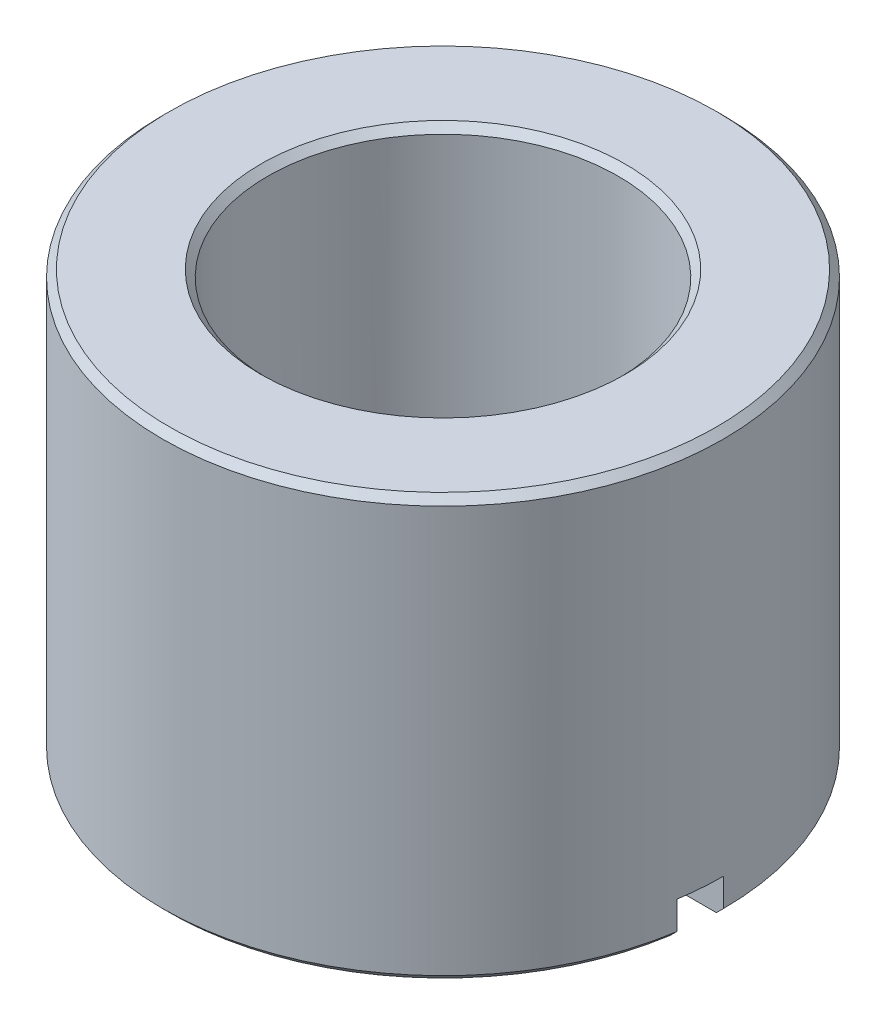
ISO-10303-21;
HEADER;
FILE_DESCRIPTION(('STEP AP214'),'2;1');
FILE_NAME('part.step','',(''),(''),'','','');
FILE_SCHEMA(('AUTOMOTIVE_DESIGN { 1 0 10303 214 1 1 1 1 }'));
ENDSEC;
DATA;
#1=APPLICATION_CONTEXT('core data for automotive mechanical design processes');
#2=APPLICATION_PROTOCOL_DEFINITION('international standard','automotive_design',2000,#1);
#3=PRODUCT_CONTEXT('',#1,'mechanical');
#4=PRODUCT('Part','Part','',(#3));
#5=PRODUCT_RELATED_PRODUCT_CATEGORY('part','',(#4));
#6=PRODUCT_DEFINITION_FORMATION('','',#4);
#7=PRODUCT_DEFINITION_CONTEXT('part definition',#1,'design');
#8=PRODUCT_DEFINITION('design','',#6,#7);
#9=PRODUCT_DEFINITION_SHAPE('','',#8);
#10=(LENGTH_UNIT() NAMED_UNIT(*) SI_UNIT(.MILLI.,.METRE.));
#11=(NAMED_UNIT(*) PLANE_ANGLE_UNIT() SI_UNIT($,.RADIAN.));
#12=(NAMED_UNIT(*) SI_UNIT($,.STERADIAN.) SOLID_ANGLE_UNIT());
#13=UNCERTAINTY_MEASURE_WITH_UNIT(LENGTH_MEASURE(1.E-05),#10,'distance_accuracy_value','');
#14=(GEOMETRIC_REPRESENTATION_CONTEXT(3) GLOBAL_UNCERTAINTY_ASSIGNED_CONTEXT((#13)) GLOBAL_UNIT_ASSIGNED_CONTEXT((#10,
#11,#12)) REPRESENTATION_CONTEXT('',''));
#15=CARTESIAN_POINT('',(0.,0.,0.));
#16=DIRECTION('',(0.,0.,1.));
#17=DIRECTION('',(1.,0.,0.));
#18=AXIS2_PLACEMENT_3D('',#15,#16,#17);
#19=CARTESIAN_POINT('',(2.,0.5,0.3085685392));
#20=DIRECTION('',(0.,1.,0.));
#21=DIRECTION('',(0.,0.,1.));
#22=AXIS2_PLACEMENT_3D('',#19,#20,#21);
#23=PLANE('',#22);
#24=DIRECTION('',(1.,0.,0.));
#25=VECTOR('',#24,1.);
#26=CARTESIAN_POINT('',(2.,0.5,0.));
#27=LINE('',#26,#25);
#28=CARTESIAN_POINT('',(4.,0.5,0.));
#29=VERTEX_POINT('',#28);
#30=CARTESIAN_POINT('',(2.5,0.5,0.));
#31=VERTEX_POINT('',#30);
#32=EDGE_CURVE('E71',#29,#31,#27,.F.);
#33=ORIENTED_EDGE('',*,*,#32,.F.);
#34=CARTESIAN_POINT('',(0.,0.5,0.));
#35=DIRECTION('',(0.,1.,0.));
#36=DIRECTION('',(0.,0.,1.));
#37=AXIS2_PLACEMENT_3D('',#34,#35,#36);
#38=CIRCLE('',#37,4.);
#39=CARTESIAN_POINT('',(3.9521059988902,0.5,0.6171370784));
#40=VERTEX_POINT('',#39);
#41=EDGE_CURVE('E20',#40,#29,#38,.T.);
#42=ORIENTED_EDGE('',*,*,#41,.F.);
#43=DIRECTION('',(-1.,0.,0.));
#44=VECTOR('',#43,1.);
#45=CARTESIAN_POINT('',(2.,0.5,0.6171370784));
#46=LINE('',#45,#44);
#47=CARTESIAN_POINT('',(2.42263117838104,0.5,0.6171370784));
#48=VERTEX_POINT('',#47);
#49=EDGE_CURVE('E68',#48,#40,#46,.F.);
#50=ORIENTED_EDGE('',*,*,#49,.F.);
#51=CARTESIAN_POINT('',(0.,0.5,0.));
#52=DIRECTION('',(0.,1.,0.));
#53=DIRECTION('',(0.,0.,1.));
#54=AXIS2_PLACEMENT_3D('',#51,#52,#53);
#55=CIRCLE('',#54,2.5);
#56=EDGE_CURVE('E75',#48,#31,#55,.T.);
#57=ORIENTED_EDGE('',*,*,#56,.T.);
#58=EDGE_LOOP('',(#33,#42,#50,#57));
#59=FACE_BOUND('',#58,.T.);
#60=ADVANCED_FACE('F17',(#59),#23,.F.);
#61=CARTESIAN_POINT('',(0.,4.,0.));
#62=DIRECTION('',(0.,1.,0.));
#63=DIRECTION('',(0.,0.,1.));
#64=AXIS2_PLACEMENT_3D('',#61,#62,#63);
#65=CYLINDRICAL_SURFACE('',#64,2.5);
#66=CARTESIAN_POINT('',(0.,5.89999999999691,0.));
#67=DIRECTION('',(0.,1.,0.));
#68=DIRECTION('',(1.,0.,0.));
#69=AXIS2_PLACEMENT_3D('',#66,#67,#68);
#70=CIRCLE('',#69,2.49999999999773);
#71=CARTESIAN_POINT('',(2.49999999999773,5.89999999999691,0.));
#72=VERTEX_POINT('',#71);
#73=EDGE_CURVE('E82',#72,#72,#70,.T.);
#74=ORIENTED_EDGE('',*,*,#73,.T.);
#75=EDGE_LOOP('',(#74));
#76=FACE_BOUND('',#75,.T.);
#77=CARTESIAN_POINT('',(0.,0.0999999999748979,0.));
#78=DIRECTION('',(0.,-1.,0.));
#79=DIRECTION('',(-1.,0.,0.));
#80=AXIS2_PLACEMENT_3D('',#77,#78,#79);
#81=CIRCLE('',#80,2.50000000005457);
#82=CARTESIAN_POINT('',(2.4226311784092,0.100000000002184,0.6171370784));
#83=VERTEX_POINT('',#82);
#84=CARTESIAN_POINT('',(2.50000000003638,0.0999999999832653,0.));
#85=VERTEX_POINT('',#84);
#86=EDGE_CURVE('E93',#83,#85,#81,.T.);
#87=ORIENTED_EDGE('',*,*,#86,.T.);
#88=DIRECTION('',(0.,1.,0.));
#89=VECTOR('',#88,1.);
#90=CARTESIAN_POINT('',(2.5,0.25,0.));
#91=LINE('',#90,#89);
#92=EDGE_CURVE('E100',#31,#85,#91,.F.);
#93=ORIENTED_EDGE('',*,*,#92,.F.);
#94=ORIENTED_EDGE('',*,*,#56,.F.);
#95=DIRECTION('',(0.,1.,0.));
#96=VECTOR('',#95,1.);
#97=CARTESIAN_POINT('',(2.42263117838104,0.25,0.6171370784));
#98=LINE('',#97,#96);
#99=EDGE_CURVE('E87',#83,#48,#98,.T.);
#100=ORIENTED_EDGE('',*,*,#99,.F.);
#101=EDGE_LOOP('',(#87,#93,#94,#100));
#102=FACE_BOUND('',#101,.T.);
#103=ADVANCED_FACE('F197',(#76,#102),#65,.F.);
#104=CARTESIAN_POINT('',(2.,0.25,0.));
#105=DIRECTION('',(0.,0.,1.));
#106=DIRECTION('',(1.,0.,0.));
#107=AXIS2_PLACEMENT_3D('',#104,#105,#106);
#108=PLANE('',#107);
#109=DIRECTION('',(-0.707106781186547,0.707106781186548,0.));
#110=VECTOR('',#109,1.);
#111=CARTESIAN_POINT('',(499000.,-498997.400000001,2.71290320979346E-10));
#112=LINE('',#111,#110);
#113=CARTESIAN_POINT('',(2.5999999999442,2.8421709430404E-11,0.));
#114=VERTEX_POINT('',#113);
#115=EDGE_CURVE('E97',#85,#114,#112,.F.);
#116=ORIENTED_EDGE('',*,*,#115,.T.);
#117=DIRECTION('',(1.,0.,0.));
#118=VECTOR('',#117,1.);
#119=CARTESIAN_POINT('',(0.,0.,0.));
#120=LINE('',#119,#118);
#121=CARTESIAN_POINT('',(3.89999999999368,0.,0.));
#122=VERTEX_POINT('',#121);
#123=EDGE_CURVE('E125',#122,#114,#120,.F.);
#124=ORIENTED_EDGE('',*,*,#123,.F.);
#125=DIRECTION('',(0.707106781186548,0.707106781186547,0.));
#126=VECTOR('',#125,1.);
#127=CARTESIAN_POINT('',(3.9,0.,0.));
#128=LINE('',#127,#126);
#129=CARTESIAN_POINT('',(4.,0.0999999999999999,0.));
#130=VERTEX_POINT('',#129);
#131=EDGE_CURVE('E35',#122,#130,#128,.T.);
#132=ORIENTED_EDGE('',*,*,#131,.T.);
#133=DIRECTION('',(0.,1.,0.));
#134=VECTOR('',#133,1.);
#135=CARTESIAN_POINT('',(4.,0.25,0.));
#136=LINE('',#135,#134);
#137=EDGE_CURVE('E106',#130,#29,#136,.T.);
#138=ORIENTED_EDGE('',*,*,#137,.T.);
#139=ORIENTED_EDGE('',*,*,#32,.T.);
#140=ORIENTED_EDGE('',*,*,#92,.T.);
#141=EDGE_LOOP('',(#116,#124,#132,#138,#139,#140));
#142=FACE_BOUND('',#141,.T.);
#143=ADVANCED_FACE('F192',(#142),#108,.T.);
#144=CARTESIAN_POINT('',(0.,0.,0.));
#145=DIRECTION('',(0.,-1.,0.));
#146=DIRECTION('',(0.,0.,-1.));
#147=AXIS2_PLACEMENT_3D('',#144,#145,#146);
#148=CONICAL_SURFACE('',#147,2.59999999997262,0.785398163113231);
#149=ORIENTED_EDGE('',*,*,#86,.F.);
#150=CARTESIAN_POINT('',(2.52569630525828,-8.50128630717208E-12,0.617137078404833));
#151=CARTESIAN_POINT('',(2.50852894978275,0.016677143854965,0.617137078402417));
#152=CARTESIAN_POINT('',(2.49135651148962,0.0333490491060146,0.617137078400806));
#153=CARTESIAN_POINT('',(2.45700146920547,0.0666823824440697,0.617137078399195));
#154=CARTESIAN_POINT('',(2.43981886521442,0.083343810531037,0.617137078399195));
#155=CARTESIAN_POINT('',(2.42263117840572,0.100000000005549,0.6171370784));
#156=B_SPLINE_CURVE_WITH_KNOTS('',3,(#150,#151,#152,#153,#154,#155),.UNSPECIFIED.,.F.,.F.,(4,2,
4),(0.,0.0718025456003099,0.14360509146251),.UNSPECIFIED.);
#157=CARTESIAN_POINT('',(2.52569630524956,-5.71369893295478E-12,0.6171370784));
#158=VERTEX_POINT('',#157);
#159=EDGE_CURVE('E89',#158,#83,#156,.T.);
#160=ORIENTED_EDGE('',*,*,#159,.F.);
#161=CARTESIAN_POINT('',(0.,0.,0.));
#162=DIRECTION('',(0.,-1.,0.));
#163=DIRECTION('',(0.,0.,-1.));
#164=AXIS2_PLACEMENT_3D('',#161,#162,#163);
#165=CIRCLE('',#164,2.59999999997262);
#166=EDGE_CURVE('E122',#114,#158,#165,.F.);
#167=ORIENTED_EDGE('',*,*,#166,.F.);
#168=ORIENTED_EDGE('',*,*,#115,.F.);
#169=EDGE_LOOP('',(#149,#160,#167,#168));
#170=FACE_BOUND('',#169,.T.);
#171=ADVANCED_FACE('F138',(#170),#148,.F.);
#172=CARTESIAN_POINT('',(2.,0.25,0.6171370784));
#173=DIRECTION('',(0.,0.,-1.));
#174=DIRECTION('',(-1.,0.,0.));
#175=AXIS2_PLACEMENT_3D('',#172,#173,#174);
#176=PLANE('',#175);
#177=ORIENTED_EDGE('',*,*,#49,.T.);
#178=DIRECTION('',(0.,1.,0.));
#179=VECTOR('',#178,1.);
#180=CARTESIAN_POINT('',(3.9521059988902,0.25,0.6171370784));
#181=LINE('',#180,#179);
#182=CARTESIAN_POINT('',(3.95210599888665,0.100000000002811,0.6171370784));
#183=VERTEX_POINT('',#182);
#184=EDGE_CURVE('E77',#40,#183,#181,.F.);
#185=ORIENTED_EDGE('',*,*,#184,.T.);
#186=CARTESIAN_POINT('',(3.9521059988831,0.100000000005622,0.6171370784));
#187=CARTESIAN_POINT('',(3.93523471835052,0.083330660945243,0.6171370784));
#188=CARTESIAN_POINT('',(3.91836211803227,0.0666626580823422,0.6171370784));
#189=CARTESIAN_POINT('',(3.88461427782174,0.0333293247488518,0.6171370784));
#190=CARTESIAN_POINT('',(3.86773903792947,0.0166639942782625,0.6171370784));
#191=CARTESIAN_POINT('',(3.85086247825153,5.15208163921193E-12,0.6171370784));
#192=B_SPLINE_CURVE_WITH_KNOTS('',3,(#186,#187,#188,#189,#190,#191),.UNSPECIFIED.,.F.,.F.,(4,2,
4),(0.,0.0711516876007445,0.142303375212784),.UNSPECIFIED.);
#193=CARTESIAN_POINT('',(3.85086247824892,2.57613032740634E-12,0.6171370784));
#194=VERTEX_POINT('',#193);
#195=EDGE_CURVE('E96',#183,#194,#192,.T.);
#196=ORIENTED_EDGE('',*,*,#195,.T.);
#197=DIRECTION('',(1.,0.,0.));
#198=VECTOR('',#197,1.);
#199=CARTESIAN_POINT('',(0.,0.,0.6171370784));
#200=LINE('',#199,#198);
#201=EDGE_CURVE('E121',#158,#194,#200,.T.);
#202=ORIENTED_EDGE('',*,*,#201,.F.);
#203=ORIENTED_EDGE('',*,*,#159,.T.);
#204=ORIENTED_EDGE('',*,*,#99,.T.);
#205=EDGE_LOOP('',(#177,#185,#196,#202,#203,#204));
#206=FACE_BOUND('',#205,.T.);
#207=ADVANCED_FACE('F84',(#206),#176,.T.);
#208=CARTESIAN_POINT('',(0.,6.00000000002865,0.));
#209=DIRECTION('',(0.,1.,0.));
#210=DIRECTION('',(0.,0.,1.));
#211=AXIS2_PLACEMENT_3D('',#208,#209,#210);
#212=CONICAL_SURFACE('',#211,2.60000000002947,0.785398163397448);
#213=CARTESIAN_POINT('',(0.,6.00000000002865,0.));
#214=DIRECTION('',(0.,1.,0.));
#215=DIRECTION('',(0.,0.,1.));
#216=AXIS2_PLACEMENT_3D('',#213,#214,#215);
#217=CIRCLE('',#216,2.60000000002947);
#218=CARTESIAN_POINT('',(0.,6.00000000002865,2.60000000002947));
#219=VERTEX_POINT('',#218);
#220=EDGE_CURVE('E118',#219,#219,#217,.F.);
#221=ORIENTED_EDGE('',*,*,#220,.F.);
#222=EDGE_LOOP('',(#221));
#223=FACE_BOUND('',#222,.T.);
#224=ORIENTED_EDGE('',*,*,#73,.F.);
#225=EDGE_LOOP('',(#224));
#226=FACE_BOUND('',#225,.T.);
#227=ADVANCED_FACE('F144',(#223,#226),#212,.F.);
#228=CARTESIAN_POINT('',(0.,0.,0.));
#229=DIRECTION('',(0.,-1.,0.));
#230=DIRECTION('',(0.,0.,-1.));
#231=AXIS2_PLACEMENT_3D('',#228,#229,#230);
#232=PLANE('',#231);
#233=ORIENTED_EDGE('',*,*,#201,.T.);
#234=CARTESIAN_POINT('',(0.,0.,0.));
#235=DIRECTION('',(0.,1.,0.));
#236=DIRECTION('',(0.,0.,1.));
#237=AXIS2_PLACEMENT_3D('',#234,#235,#236);
#238=CIRCLE('',#237,3.89999999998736);
#239=EDGE_CURVE('E116',#122,#194,#238,.T.);
#240=ORIENTED_EDGE('',*,*,#239,.F.);
#241=ORIENTED_EDGE('',*,*,#123,.T.);
#242=ORIENTED_EDGE('',*,*,#166,.T.);
#243=EDGE_LOOP('',(#233,#240,#241,#242));
#244=FACE_BOUND('',#243,.T.);
#245=ADVANCED_FACE('F148',(#244),#232,.T.);
#246=CARTESIAN_POINT('',(0.,6.,0.));
#247=DIRECTION('',(0.,1.,0.));
#248=DIRECTION('',(0.,0.,1.));
#249=AXIS2_PLACEMENT_3D('',#246,#247,#248);
#250=PLANE('',#249);
#251=CARTESIAN_POINT('',(0.,6.00000000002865,0.));
#252=DIRECTION('',(0.,-1.,0.));
#253=DIRECTION('',(0.,0.,-1.));
#254=AXIS2_PLACEMENT_3D('',#251,#252,#253);
#255=CIRCLE('',#254,3.89999999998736);
#256=CARTESIAN_POINT('',(0.,6.00000000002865,-3.89999999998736));
#257=VERTEX_POINT('',#256);
#258=EDGE_CURVE('E111',#257,#257,#255,.T.);
#259=ORIENTED_EDGE('',*,*,#258,.F.);
#260=EDGE_LOOP('',(#259));
#261=FACE_BOUND('',#260,.T.);
#262=ORIENTED_EDGE('',*,*,#220,.T.);
#263=EDGE_LOOP('',(#262));
#264=FACE_BOUND('',#263,.T.);
#265=ADVANCED_FACE('F152',(#261,#264),#250,.T.);
#266=CARTESIAN_POINT('',(0.,0.0999999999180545,0.));
#267=DIRECTION('',(0.,1.,0.));
#268=DIRECTION('',(0.,0.,1.));
#269=AXIS2_PLACEMENT_3D('',#266,#267,#268);
#270=CONICAL_SURFACE('',#269,3.99999999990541,0.785398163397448);
#271=CARTESIAN_POINT('',(0.,0.0999999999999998,0.));
#272=DIRECTION('',(0.,1.,0.));
#273=DIRECTION('',(0.,0.,1.));
#274=AXIS2_PLACEMENT_3D('',#271,#272,#273);
#275=CIRCLE('',#274,4.);
#276=EDGE_CURVE('E26',#130,#183,#275,.T.);
#277=ORIENTED_EDGE('',*,*,#276,.F.);
#278=ORIENTED_EDGE('',*,*,#131,.F.);
#279=ORIENTED_EDGE('',*,*,#239,.T.);
#280=ORIENTED_EDGE('',*,*,#195,.F.);
#281=EDGE_LOOP('',(#277,#278,#279,#280));
#282=FACE_BOUND('',#281,.T.);
#283=ADVANCED_FACE('F155',(#282),#270,.T.);
#284=CARTESIAN_POINT('',(0.,5.89999999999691,0.));
#285=DIRECTION('',(0.,-1.,0.));
#286=DIRECTION('',(0.,0.,-1.));
#287=AXIS2_PLACEMENT_3D('',#284,#285,#286);
#288=CONICAL_SURFACE('',#287,3.99999999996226,0.785398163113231);
#289=CARTESIAN_POINT('',(0.,5.9,0.));
#290=DIRECTION('',(0.,1.,0.));
#291=DIRECTION('',(0.,0.,1.));
#292=AXIS2_PLACEMENT_3D('',#289,#290,#291);
#293=CIRCLE('',#292,4.);
#294=CARTESIAN_POINT('',(0.,5.9,4.));
#295=VERTEX_POINT('',#294);
#296=EDGE_CURVE('E11',#295,#295,#293,.F.);
#297=ORIENTED_EDGE('',*,*,#296,.F.);
#298=EDGE_LOOP('',(#297));
#299=FACE_BOUND('',#298,.T.);
#300=ORIENTED_EDGE('',*,*,#258,.T.);
#301=EDGE_LOOP('',(#300));
#302=FACE_BOUND('',#301,.T.);
#303=ADVANCED_FACE('F160',(#299,#302),#288,.T.);
#304=CARTESIAN_POINT('',(0.,3.,0.));
#305=DIRECTION('',(0.,1.,0.));
#306=DIRECTION('',(0.,0.,1.));
#307=AXIS2_PLACEMENT_3D('',#304,#305,#306);
#308=CYLINDRICAL_SURFACE('',#307,4.);
#309=ORIENTED_EDGE('',*,*,#296,.T.);
#310=EDGE_LOOP('',(#309));
#311=FACE_BOUND('',#310,.T.);
#312=ORIENTED_EDGE('',*,*,#276,.T.);
#313=ORIENTED_EDGE('',*,*,#184,.F.);
#314=ORIENTED_EDGE('',*,*,#41,.T.);
#315=ORIENTED_EDGE('',*,*,#137,.F.);
#316=EDGE_LOOP('',(#312,#313,#314,#315));
#317=FACE_BOUND('',#316,.T.);
#318=ADVANCED_FACE('F78',(#311,#317),#308,.T.);
#319=CLOSED_SHELL('',(#60,#103,#143,#171,#207,#227,#245,#265,#283,#303,#318));
#320=MANIFOLD_SOLID_BREP('B1',#319);
#321=ADVANCED_BREP_SHAPE_REPRESENTATION('',(#18,#320),#14);
#322=SHAPE_DEFINITION_REPRESENTATION(#9,#321);
ENDSEC;
END-ISO-10303-21;
